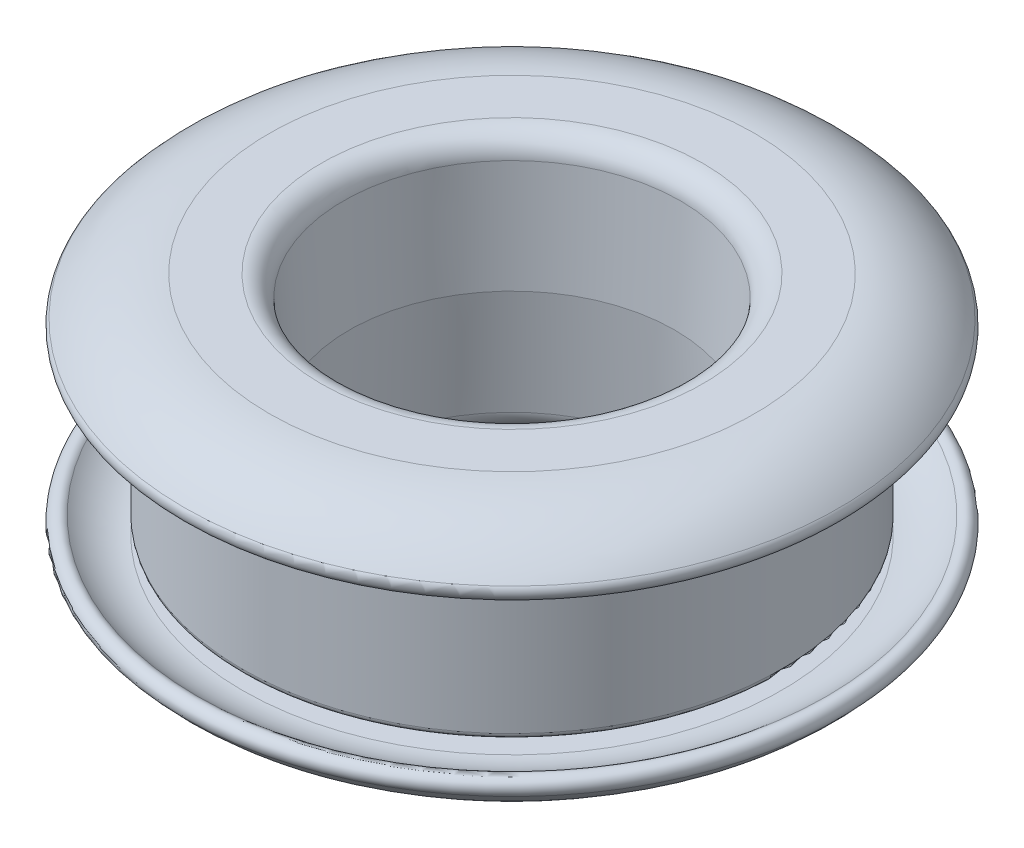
from build123d import *

# Parameters (mm, degrees)
FILLET1_R            = 0.635
FILLET1_OF_MIRROR1_R = 0.635


with BuildPart() as part:
    # Sketch1 → Revolve1 (revolve)
    with BuildSketch(Plane.XY, mode=Mode.PRIVATE) as revolve1_sk:
        with BuildLine():
            Line((18.404077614, 0), (19.05, 12.324933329))
            ThreePointArc((19.05, 12.324933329), (19.838098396, 14.034450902), (21.586519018, 14.732))
            Line((21.586519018, 14.732), (27.444472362, 14.732))
            ThreePointArc((27.444472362, 14.732), (32.717428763, 13.570821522), (37.014861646, 10.302109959))
            ThreePointArc((37.014861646, 10.302109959), (36.947889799, 8.915600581), (35.56, 8.89))
            ThreePointArc((35.56, 8.89), (33.201001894, 10.336963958), (30.48, 10.841667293))
            Line((30.48, 10.841667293), (24.820547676, 10.841667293))
            ThreePointArc((24.820547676, 10.841667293), (23.131050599, 10.119833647), (24.820547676, 9.398))
            Line((24.820547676, 9.398), (30.48, 9.398))
            Line((30.48, 9.398), (30.48, 0))
            Line((30.48, 0), (18.404077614, 0))
        make_face()
    revolve1 = revolve(revolve1_sk.sketch.rotate(Axis((0, 0, 0), (0, 1, 0)), 90), axis=Axis((0, 0, 0), (0, 1, 0)))

    # Fillet1
    fillet1_edges = [part.edges().sort_by_distance(p)[0] for p in [
        (0, 9.398, 30.48),
    ]]
    fillet(fillet1_edges, radius=FILLET1_R)

    # Mirror1: Revolve1 across plane
    add(revolve1.mirror(Plane.ZX))

    # Fillet1 of Mirror1
    fillet1_of_mirror1_edges = [part.edges().sort_by_distance(p)[0] for p in [
        (0, -9.398, 30.48),
    ]]
    fillet(fillet1_of_mirror1_edges, radius=FILLET1_OF_MIRROR1_R)


solid = part.part
